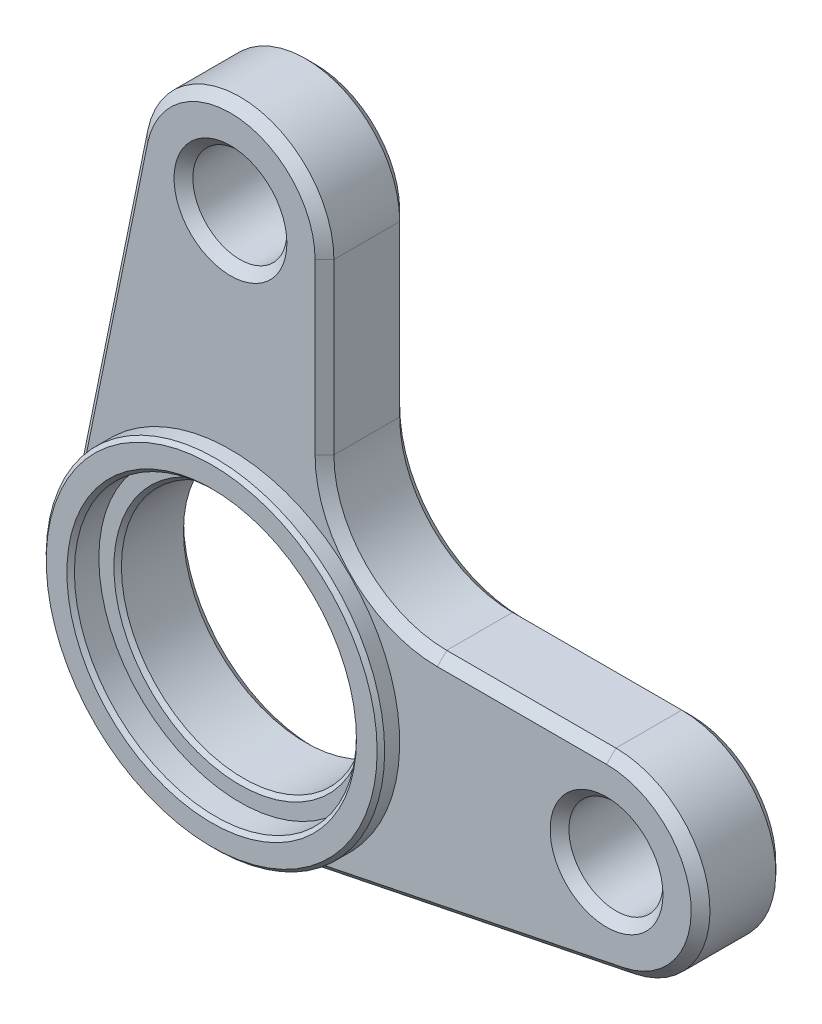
ISO-10303-21;
HEADER;
FILE_DESCRIPTION(('STEP AP214'),'2;1');
FILE_NAME('part.step','',(''),(''),'','','');
FILE_SCHEMA(('AUTOMOTIVE_DESIGN { 1 0 10303 214 1 1 1 1 }'));
ENDSEC;
DATA;
#1=APPLICATION_CONTEXT('core data for automotive mechanical design processes');
#2=APPLICATION_PROTOCOL_DEFINITION('international standard','automotive_design',2000,#1);
#3=PRODUCT_CONTEXT('',#1,'mechanical');
#4=PRODUCT('Part','Part','',(#3));
#5=PRODUCT_RELATED_PRODUCT_CATEGORY('part','',(#4));
#6=PRODUCT_DEFINITION_FORMATION('','',#4);
#7=PRODUCT_DEFINITION_CONTEXT('part definition',#1,'design');
#8=PRODUCT_DEFINITION('design','',#6,#7);
#9=PRODUCT_DEFINITION_SHAPE('','',#8);
#10=(LENGTH_UNIT() NAMED_UNIT(*) SI_UNIT(.MILLI.,.METRE.));
#11=(NAMED_UNIT(*) PLANE_ANGLE_UNIT() SI_UNIT($,.RADIAN.));
#12=(NAMED_UNIT(*) SI_UNIT($,.STERADIAN.) SOLID_ANGLE_UNIT());
#13=UNCERTAINTY_MEASURE_WITH_UNIT(LENGTH_MEASURE(1.E-05),#10,'distance_accuracy_value','');
#14=(GEOMETRIC_REPRESENTATION_CONTEXT(3) GLOBAL_UNCERTAINTY_ASSIGNED_CONTEXT((#13)) GLOBAL_UNIT_ASSIGNED_CONTEXT((#10,
#11,#12)) REPRESENTATION_CONTEXT('',''));
#15=CARTESIAN_POINT('',(0.,0.,0.));
#16=DIRECTION('',(0.,0.,1.));
#17=DIRECTION('',(1.,0.,0.));
#18=AXIS2_PLACEMENT_3D('',#15,#16,#17);
#19=CARTESIAN_POINT('',(0.,0.,4.5));
#20=DIRECTION('',(0.,0.,-1.));
#21=DIRECTION('',(-1.,0.,0.));
#22=AXIS2_PLACEMENT_3D('',#19,#20,#21);
#23=CYLINDRICAL_SURFACE('',#22,6.5);
#24=CARTESIAN_POINT('',(0.,0.,3.8));
#25=DIRECTION('',(0.,0.,1.));
#26=DIRECTION('',(1.,0.,0.));
#27=AXIS2_PLACEMENT_3D('',#24,#25,#26);
#28=CIRCLE('',#27,6.5);
#29=CARTESIAN_POINT('',(6.5,0.,3.8));
#30=VERTEX_POINT('',#29);
#31=EDGE_CURVE('E43',#30,#30,#28,.T.);
#32=ORIENTED_EDGE('',*,*,#31,.T.);
#33=EDGE_LOOP('',(#32));
#34=FACE_BOUND('',#33,.T.);
#35=CARTESIAN_POINT('',(0.,0.,0.500000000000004));
#36=DIRECTION('',(0.,0.,1.));
#37=DIRECTION('',(1.,0.,0.));
#38=AXIS2_PLACEMENT_3D('',#35,#36,#37);
#39=CIRCLE('',#38,6.5);
#40=CARTESIAN_POINT('',(6.5,0.,0.500000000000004));
#41=VERTEX_POINT('',#40);
#42=EDGE_CURVE('E221',#41,#41,#39,.F.);
#43=ORIENTED_EDGE('',*,*,#42,.T.);
#44=EDGE_LOOP('',(#43));
#45=FACE_BOUND('',#44,.T.);
#46=ADVANCED_FACE('F35',(#34,#45),#23,.F.);
#47=CARTESIAN_POINT('',(20.,0.,4.5));
#48=DIRECTION('',(0.,0.,1.));
#49=DIRECTION('',(1.,0.,0.));
#50=AXIS2_PLACEMENT_3D('',#47,#48,#49);
#51=PLANE('',#50);
#52=CARTESIAN_POINT('',(20.,0.,4.5));
#53=DIRECTION('',(0.,0.,1.));
#54=DIRECTION('',(1.,0.,0.));
#55=AXIS2_PLACEMENT_3D('',#52,#53,#54);
#56=CIRCLE('',#55,3.);
#57=CARTESIAN_POINT('',(23.,0.,4.5));
#58=VERTEX_POINT('',#57);
#59=EDGE_CURVE('E181',#58,#58,#56,.F.);
#60=ORIENTED_EDGE('',*,*,#59,.T.);
#61=EDGE_LOOP('',(#60));
#62=FACE_BOUND('',#61,.T.);
#63=CARTESIAN_POINT('',(0.,20.,4.5));
#64=DIRECTION('',(0.,0.,1.));
#65=DIRECTION('',(1.,0.,0.));
#66=AXIS2_PLACEMENT_3D('',#63,#64,#65);
#67=CIRCLE('',#66,3.);
#68=CARTESIAN_POINT('',(3.,20.,4.5));
#69=VERTEX_POINT('',#68);
#70=EDGE_CURVE('E177',#69,#69,#67,.F.);
#71=ORIENTED_EDGE('',*,*,#70,.T.);
#72=EDGE_LOOP('',(#71));
#73=FACE_BOUND('',#72,.T.);
#74=CARTESIAN_POINT('',(0.,0.,4.5));
#75=DIRECTION('',(0.,0.,1.));
#76=DIRECTION('',(1.,0.,0.));
#77=AXIS2_PLACEMENT_3D('',#74,#75,#76);
#78=CIRCLE('',#77,9.);
#79=CARTESIAN_POINT('',(4.59827534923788,-7.73665714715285,4.5));
#80=VERTEX_POINT('',#79);
#81=CARTESIAN_POINT('',(-7.73665714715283,4.5982753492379,4.5));
#82=VERTEX_POINT('',#81);
#83=EDGE_CURVE('E155',#80,#82,#78,.T.);
#84=ORIENTED_EDGE('',*,*,#83,.F.);
#85=DIRECTION('',(0.979795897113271,0.2,0.));
#86=VECTOR('',#85,1.);
#87=CARTESIAN_POINT('',(20.9,-4.40908153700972,4.5));
#88=LINE('',#87,#86);
#89=CARTESIAN_POINT('',(20.9,-4.40908153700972,4.5));
#90=VERTEX_POINT('',#89);
#91=EDGE_CURVE('E167',#80,#90,#88,.T.);
#92=ORIENTED_EDGE('',*,*,#91,.T.);
#93=CARTESIAN_POINT('',(20.,0.,4.5));
#94=DIRECTION('',(0.,0.,1.));
#95=DIRECTION('',(1.,0.,0.));
#96=AXIS2_PLACEMENT_3D('',#93,#94,#95);
#97=CIRCLE('',#96,4.5);
#98=CARTESIAN_POINT('',(20.,4.5,4.5));
#99=VERTEX_POINT('',#98);
#100=EDGE_CURVE('E178',#90,#99,#97,.T.);
#101=ORIENTED_EDGE('',*,*,#100,.T.);
#102=DIRECTION('',(-1.,0.,0.));
#103=VECTOR('',#102,1.);
#104=CARTESIAN_POINT('',(11.,4.5,4.5));
#105=LINE('',#104,#103);
#106=CARTESIAN_POINT('',(11.,4.5,4.5));
#107=VERTEX_POINT('',#106);
#108=EDGE_CURVE('E183',#99,#107,#105,.T.);
#109=ORIENTED_EDGE('',*,*,#108,.T.);
#110=CARTESIAN_POINT('',(11.,11.,4.5));
#111=DIRECTION('',(0.,0.,1.));
#112=DIRECTION('',(1.,0.,0.));
#113=AXIS2_PLACEMENT_3D('',#110,#111,#112);
#114=CIRCLE('',#113,6.5);
#115=CARTESIAN_POINT('',(4.5,11.,4.5));
#116=VERTEX_POINT('',#115);
#117=EDGE_CURVE('E494',#107,#116,#114,.F.);
#118=ORIENTED_EDGE('',*,*,#117,.T.);
#119=DIRECTION('',(0.,1.,0.));
#120=VECTOR('',#119,1.);
#121=CARTESIAN_POINT('',(4.5,20.,4.5));
#122=LINE('',#121,#120);
#123=CARTESIAN_POINT('',(4.5,20.,4.5));
#124=VERTEX_POINT('',#123);
#125=EDGE_CURVE('E490',#116,#124,#122,.T.);
#126=ORIENTED_EDGE('',*,*,#125,.T.);
#127=CARTESIAN_POINT('',(0.,20.,4.5));
#128=DIRECTION('',(0.,0.,1.));
#129=DIRECTION('',(1.,0.,0.));
#130=AXIS2_PLACEMENT_3D('',#127,#128,#129);
#131=CIRCLE('',#130,4.5);
#132=CARTESIAN_POINT('',(-4.40908153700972,20.9,4.5));
#133=VERTEX_POINT('',#132);
#134=EDGE_CURVE('E492',#124,#133,#131,.T.);
#135=ORIENTED_EDGE('',*,*,#134,.T.);
#136=DIRECTION('',(-0.2,-0.979795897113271,0.));
#137=VECTOR('',#136,1.);
#138=CARTESIAN_POINT('',(-8.3282651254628,1.7,4.5));
#139=LINE('',#138,#137);
#140=EDGE_CURVE('E169',#133,#82,#139,.T.);
#141=ORIENTED_EDGE('',*,*,#140,.T.);
#142=EDGE_LOOP('',(#84,#92,#101,#109,#118,#126,#135,#141));
#143=FACE_BOUND('',#142,.T.);
#144=ADVANCED_FACE('F166',(#62,#73,#143),#51,.T.);
#145=CARTESIAN_POINT('',(20.,0.,0.));
#146=DIRECTION('',(0.,0.,1.));
#147=DIRECTION('',(1.,0.,0.));
#148=AXIS2_PLACEMENT_3D('',#145,#146,#147);
#149=PLANE('',#148);
#150=CARTESIAN_POINT('',(20.,0.,0.));
#151=DIRECTION('',(0.,0.,1.));
#152=DIRECTION('',(1.,0.,0.));
#153=AXIS2_PLACEMENT_3D('',#150,#151,#152);
#154=CIRCLE('',#153,3.);
#155=CARTESIAN_POINT('',(23.,0.,0.));
#156=VERTEX_POINT('',#155);
#157=EDGE_CURVE('E218',#156,#156,#154,.T.);
#158=ORIENTED_EDGE('',*,*,#157,.T.);
#159=EDGE_LOOP('',(#158));
#160=FACE_BOUND('',#159,.T.);
#161=CARTESIAN_POINT('',(0.,20.,0.));
#162=DIRECTION('',(0.,0.,1.));
#163=DIRECTION('',(1.,0.,0.));
#164=AXIS2_PLACEMENT_3D('',#161,#162,#163);
#165=CIRCLE('',#164,3.);
#166=CARTESIAN_POINT('',(3.,20.,0.));
#167=VERTEX_POINT('',#166);
#168=EDGE_CURVE('E215',#167,#167,#165,.T.);
#169=ORIENTED_EDGE('',*,*,#168,.T.);
#170=EDGE_LOOP('',(#169));
#171=FACE_BOUND('',#170,.T.);
#172=CARTESIAN_POINT('',(0.,0.,0.));
#173=DIRECTION('',(0.,0.,1.));
#174=DIRECTION('',(1.,0.,0.));
#175=AXIS2_PLACEMENT_3D('',#172,#173,#174);
#176=CIRCLE('',#175,7.00000000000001);
#177=CARTESIAN_POINT('',(7.00000000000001,0.,0.));
#178=VERTEX_POINT('',#177);
#179=EDGE_CURVE('E212',#178,#178,#176,.T.);
#180=ORIENTED_EDGE('',*,*,#179,.T.);
#181=EDGE_LOOP('',(#180));
#182=FACE_BOUND('',#181,.T.);
#183=CARTESIAN_POINT('',(11.,11.,0.));
#184=DIRECTION('',(0.,0.,1.));
#185=DIRECTION('',(1.,0.,0.));
#186=AXIS2_PLACEMENT_3D('',#183,#184,#185);
#187=CIRCLE('',#186,6.50000000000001);
#188=CARTESIAN_POINT('',(4.49999999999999,11.,0.));
#189=VERTEX_POINT('',#188);
#190=CARTESIAN_POINT('',(11.,4.49999999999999,0.));
#191=VERTEX_POINT('',#190);
#192=EDGE_CURVE('E207',#189,#191,#187,.T.);
#193=ORIENTED_EDGE('',*,*,#192,.T.);
#194=DIRECTION('',(1.,0.,0.));
#195=VECTOR('',#194,1.);
#196=CARTESIAN_POINT('',(20.,4.49999999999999,0.));
#197=LINE('',#196,#195);
#198=CARTESIAN_POINT('',(20.,4.49999999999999,0.));
#199=VERTEX_POINT('',#198);
#200=EDGE_CURVE('E209',#191,#199,#197,.T.);
#201=ORIENTED_EDGE('',*,*,#200,.T.);
#202=CARTESIAN_POINT('',(20.,0.,0.));
#203=DIRECTION('',(0.,0.,1.));
#204=DIRECTION('',(1.,0.,0.));
#205=AXIS2_PLACEMENT_3D('',#202,#203,#204);
#206=CIRCLE('',#205,4.49999999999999);
#207=CARTESIAN_POINT('',(20.9,-4.40908153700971,0.));
#208=VERTEX_POINT('',#207);
#209=EDGE_CURVE('E195',#199,#208,#206,.F.);
#210=ORIENTED_EDGE('',*,*,#209,.T.);
#211=DIRECTION('',(-0.979795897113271,-0.2,0.));
#212=VECTOR('',#211,1.);
#213=CARTESIAN_POINT('',(20.9,-4.40908153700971,0.));
#214=LINE('',#213,#212);
#215=CARTESIAN_POINT('',(1.7,-8.3282651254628,0.));
#216=VERTEX_POINT('',#215);
#217=EDGE_CURVE('E197',#208,#216,#214,.T.);
#218=ORIENTED_EDGE('',*,*,#217,.T.);
#219=CARTESIAN_POINT('',(0.,0.,0.));
#220=DIRECTION('',(0.,0.,1.));
#221=DIRECTION('',(1.,0.,0.));
#222=AXIS2_PLACEMENT_3D('',#219,#220,#221);
#223=CIRCLE('',#222,8.49999999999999);
#224=CARTESIAN_POINT('',(-8.3282651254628,1.7,0.));
#225=VERTEX_POINT('',#224);
#226=EDGE_CURVE('E199',#216,#225,#223,.F.);
#227=ORIENTED_EDGE('',*,*,#226,.T.);
#228=DIRECTION('',(0.2,0.979795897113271,0.));
#229=VECTOR('',#228,1.);
#230=CARTESIAN_POINT('',(-7.52826512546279,5.61918358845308,0.));
#231=LINE('',#230,#229);
#232=CARTESIAN_POINT('',(-4.40908153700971,20.9,0.));
#233=VERTEX_POINT('',#232);
#234=EDGE_CURVE('E201',#225,#233,#231,.T.);
#235=ORIENTED_EDGE('',*,*,#234,.T.);
#236=CARTESIAN_POINT('',(0.,20.,0.));
#237=DIRECTION('',(0.,0.,1.));
#238=DIRECTION('',(1.,0.,0.));
#239=AXIS2_PLACEMENT_3D('',#236,#237,#238);
#240=CIRCLE('',#239,4.49999999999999);
#241=CARTESIAN_POINT('',(4.49999999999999,20.,0.));
#242=VERTEX_POINT('',#241);
#243=EDGE_CURVE('E203',#233,#242,#240,.F.);
#244=ORIENTED_EDGE('',*,*,#243,.T.);
#245=DIRECTION('',(0.,-1.,0.));
#246=VECTOR('',#245,1.);
#247=CARTESIAN_POINT('',(4.49999999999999,0.,0.));
#248=LINE('',#247,#246);
#249=EDGE_CURVE('E205',#242,#189,#248,.T.);
#250=ORIENTED_EDGE('',*,*,#249,.T.);
#251=EDGE_LOOP('',(#193,#201,#210,#218,#227,#235,#244,#250));
#252=FACE_BOUND('',#251,.T.);
#253=ADVANCED_FACE('F322',(#160,#171,#182,#252),#149,.F.);
#254=CARTESIAN_POINT('',(20.,0.,4.5));
#255=DIRECTION('',(0.,0.,-1.));
#256=DIRECTION('',(-1.,0.,0.));
#257=AXIS2_PLACEMENT_3D('',#254,#255,#256);
#258=CYLINDRICAL_SURFACE('',#257,5.);
#259=DIRECTION('',(0.,0.,-1.));
#260=VECTOR('',#259,1.);
#261=CARTESIAN_POINT('',(21.,-4.89897948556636,4.5));
#262=LINE('',#261,#260);
#263=CARTESIAN_POINT('',(21.,-4.89897948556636,4.));
#264=VERTEX_POINT('',#263);
#265=CARTESIAN_POINT('',(21.,-4.89897948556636,0.500000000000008));
#266=VERTEX_POINT('',#265);
#267=EDGE_CURVE('E464',#264,#266,#262,.T.);
#268=ORIENTED_EDGE('',*,*,#267,.T.);
#269=CARTESIAN_POINT('',(20.,0.,0.500000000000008));
#270=DIRECTION('',(0.,0.,1.));
#271=DIRECTION('',(1.,0.,0.));
#272=AXIS2_PLACEMENT_3D('',#269,#270,#271);
#273=CIRCLE('',#272,5.);
#274=CARTESIAN_POINT('',(20.,5.,0.500000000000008));
#275=VERTEX_POINT('',#274);
#276=EDGE_CURVE('E162',#266,#275,#273,.T.);
#277=ORIENTED_EDGE('',*,*,#276,.T.);
#278=DIRECTION('',(0.,0.,-1.));
#279=VECTOR('',#278,1.);
#280=CARTESIAN_POINT('',(20.,5.,4.5));
#281=LINE('',#280,#279);
#282=CARTESIAN_POINT('',(20.,5.,4.));
#283=VERTEX_POINT('',#282);
#284=EDGE_CURVE('E171',#283,#275,#281,.T.);
#285=ORIENTED_EDGE('',*,*,#284,.F.);
#286=CARTESIAN_POINT('',(20.,0.,4.));
#287=DIRECTION('',(0.,0.,1.));
#288=DIRECTION('',(1.,0.,0.));
#289=AXIS2_PLACEMENT_3D('',#286,#287,#288);
#290=CIRCLE('',#289,5.);
#291=EDGE_CURVE('E57',#283,#264,#290,.F.);
#292=ORIENTED_EDGE('',*,*,#291,.T.);
#293=EDGE_LOOP('',(#268,#277,#285,#292));
#294=FACE_BOUND('',#293,.T.);
#295=ADVANCED_FACE('F331',(#294),#258,.T.);
#296=CARTESIAN_POINT('',(11.,5.,4.5));
#297=DIRECTION('',(0.,-1.,0.));
#298=DIRECTION('',(0.,0.,-1.));
#299=AXIS2_PLACEMENT_3D('',#296,#297,#298);
#300=PLANE('',#299);
#301=ORIENTED_EDGE('',*,*,#284,.T.);
#302=DIRECTION('',(-1.,0.,0.));
#303=VECTOR('',#302,1.);
#304=CARTESIAN_POINT('',(11.,5.,0.500000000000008));
#305=LINE('',#304,#303);
#306=CARTESIAN_POINT('',(11.,5.,0.500000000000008));
#307=VERTEX_POINT('',#306);
#308=EDGE_CURVE('E226',#275,#307,#305,.T.);
#309=ORIENTED_EDGE('',*,*,#308,.T.);
#310=DIRECTION('',(0.,0.,-1.));
#311=VECTOR('',#310,1.);
#312=CARTESIAN_POINT('',(11.,5.,4.5));
#313=LINE('',#312,#311);
#314=CARTESIAN_POINT('',(11.,5.,4.));
#315=VERTEX_POINT('',#314);
#316=EDGE_CURVE('E480',#315,#307,#313,.T.);
#317=ORIENTED_EDGE('',*,*,#316,.F.);
#318=DIRECTION('',(1.,0.,0.));
#319=VECTOR('',#318,1.);
#320=CARTESIAN_POINT('',(20.,5.,4.));
#321=LINE('',#320,#319);
#322=EDGE_CURVE('E224',#315,#283,#321,.T.);
#323=ORIENTED_EDGE('',*,*,#322,.T.);
#324=EDGE_LOOP('',(#301,#309,#317,#323));
#325=FACE_BOUND('',#324,.T.);
#326=ADVANCED_FACE('F354',(#325),#300,.F.);
#327=CARTESIAN_POINT('',(11.,11.,4.5));
#328=DIRECTION('',(0.,0.,-1.));
#329=DIRECTION('',(-1.,0.,0.));
#330=AXIS2_PLACEMENT_3D('',#327,#328,#329);
#331=CYLINDRICAL_SURFACE('',#330,6.);
#332=ORIENTED_EDGE('',*,*,#316,.T.);
#333=CARTESIAN_POINT('',(11.,11.,0.500000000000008));
#334=DIRECTION('',(0.,0.,1.));
#335=DIRECTION('',(1.,0.,0.));
#336=AXIS2_PLACEMENT_3D('',#333,#334,#335);
#337=CIRCLE('',#336,6.);
#338=CARTESIAN_POINT('',(5.,11.,0.500000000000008));
#339=VERTEX_POINT('',#338);
#340=EDGE_CURVE('E231',#307,#339,#337,.F.);
#341=ORIENTED_EDGE('',*,*,#340,.T.);
#342=DIRECTION('',(0.,0.,-1.));
#343=VECTOR('',#342,1.);
#344=CARTESIAN_POINT('',(5.,11.,4.5));
#345=LINE('',#344,#343);
#346=CARTESIAN_POINT('',(5.,11.,4.));
#347=VERTEX_POINT('',#346);
#348=EDGE_CURVE('E477',#347,#339,#345,.T.);
#349=ORIENTED_EDGE('',*,*,#348,.F.);
#350=CARTESIAN_POINT('',(11.,11.,4.));
#351=DIRECTION('',(0.,0.,1.));
#352=DIRECTION('',(1.,0.,0.));
#353=AXIS2_PLACEMENT_3D('',#350,#351,#352);
#354=CIRCLE('',#353,6.);
#355=EDGE_CURVE('E229',#347,#315,#354,.T.);
#356=ORIENTED_EDGE('',*,*,#355,.T.);
#357=EDGE_LOOP('',(#332,#341,#349,#356));
#358=FACE_BOUND('',#357,.T.);
#359=ADVANCED_FACE('F350',(#358),#331,.F.);
#360=CARTESIAN_POINT('',(5.,20.,4.5));
#361=DIRECTION('',(-1.,0.,0.));
#362=DIRECTION('',(0.,-1.,0.));
#363=AXIS2_PLACEMENT_3D('',#360,#361,#362);
#364=PLANE('',#363);
#365=ORIENTED_EDGE('',*,*,#348,.T.);
#366=DIRECTION('',(0.,1.,0.));
#367=VECTOR('',#366,1.);
#368=CARTESIAN_POINT('',(5.,20.,0.500000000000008));
#369=LINE('',#368,#367);
#370=CARTESIAN_POINT('',(5.,20.,0.500000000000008));
#371=VERTEX_POINT('',#370);
#372=EDGE_CURVE('E235',#339,#371,#369,.T.);
#373=ORIENTED_EDGE('',*,*,#372,.T.);
#374=DIRECTION('',(0.,0.,-1.));
#375=VECTOR('',#374,1.);
#376=CARTESIAN_POINT('',(5.,20.,4.5));
#377=LINE('',#376,#375);
#378=CARTESIAN_POINT('',(5.,20.,4.));
#379=VERTEX_POINT('',#378);
#380=EDGE_CURVE('E474',#379,#371,#377,.T.);
#381=ORIENTED_EDGE('',*,*,#380,.F.);
#382=DIRECTION('',(0.,-1.,0.));
#383=VECTOR('',#382,1.);
#384=CARTESIAN_POINT('',(5.,11.,4.));
#385=LINE('',#384,#383);
#386=EDGE_CURVE('E233',#379,#347,#385,.T.);
#387=ORIENTED_EDGE('',*,*,#386,.T.);
#388=EDGE_LOOP('',(#365,#373,#381,#387));
#389=FACE_BOUND('',#388,.T.);
#390=ADVANCED_FACE('F346',(#389),#364,.F.);
#391=CARTESIAN_POINT('',(0.,20.,4.5));
#392=DIRECTION('',(0.,0.,-1.));
#393=DIRECTION('',(-1.,0.,0.));
#394=AXIS2_PLACEMENT_3D('',#391,#392,#393);
#395=CYLINDRICAL_SURFACE('',#394,5.);
#396=ORIENTED_EDGE('',*,*,#380,.T.);
#397=CARTESIAN_POINT('',(0.,20.,0.500000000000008));
#398=DIRECTION('',(0.,0.,1.));
#399=DIRECTION('',(1.,0.,0.));
#400=AXIS2_PLACEMENT_3D('',#397,#398,#399);
#401=CIRCLE('',#400,5.);
#402=CARTESIAN_POINT('',(-4.89897948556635,21.,0.500000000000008));
#403=VERTEX_POINT('',#402);
#404=EDGE_CURVE('E239',#371,#403,#401,.T.);
#405=ORIENTED_EDGE('',*,*,#404,.T.);
#406=DIRECTION('',(0.,0.,-1.));
#407=VECTOR('',#406,1.);
#408=CARTESIAN_POINT('',(-4.89897948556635,21.,4.5));
#409=LINE('',#408,#407);
#410=CARTESIAN_POINT('',(-4.89897948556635,21.,4.));
#411=VERTEX_POINT('',#410);
#412=EDGE_CURVE('E471',#411,#403,#409,.T.);
#413=ORIENTED_EDGE('',*,*,#412,.F.);
#414=CARTESIAN_POINT('',(0.,20.,4.));
#415=DIRECTION('',(0.,0.,1.));
#416=DIRECTION('',(1.,0.,0.));
#417=AXIS2_PLACEMENT_3D('',#414,#415,#416);
#418=CIRCLE('',#417,5.);
#419=EDGE_CURVE('E237',#411,#379,#418,.F.);
#420=ORIENTED_EDGE('',*,*,#419,.T.);
#421=EDGE_LOOP('',(#396,#405,#413,#420));
#422=FACE_BOUND('',#421,.T.);
#423=ADVANCED_FACE('F342',(#422),#395,.T.);
#424=CARTESIAN_POINT('',(-4.89897948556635,21.,4.5));
#425=DIRECTION('',(0.979795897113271,-0.2,0.));
#426=DIRECTION('',(0.2,0.979795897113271,0.));
#427=AXIS2_PLACEMENT_3D('',#424,#425,#426);
#428=PLANE('',#427);
#429=ORIENTED_EDGE('',*,*,#412,.T.);
#430=DIRECTION('',(-0.2,-0.979795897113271,0.));
#431=VECTOR('',#430,1.);
#432=CARTESIAN_POINT('',(-4.89897948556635,21.,0.500000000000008));
#433=LINE('',#432,#431);
#434=CARTESIAN_POINT('',(-8.81816307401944,1.8,0.500000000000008));
#435=VERTEX_POINT('',#434);
#436=EDGE_CURVE('E243',#403,#435,#433,.T.);
#437=ORIENTED_EDGE('',*,*,#436,.T.);
#438=DIRECTION('',(0.,0.,-1.));
#439=VECTOR('',#438,1.);
#440=CARTESIAN_POINT('',(-8.81816307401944,1.8,4.5));
#441=LINE('',#440,#439);
#442=CARTESIAN_POINT('',(-8.81816307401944,1.8,4.));
#443=VERTEX_POINT('',#442);
#444=EDGE_CURVE('E469',#443,#435,#441,.T.);
#445=ORIENTED_EDGE('',*,*,#444,.F.);
#446=DIRECTION('',(0.2,0.979795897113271,0.));
#447=VECTOR('',#446,1.);
#448=CARTESIAN_POINT('',(-4.89897948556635,21.,4.));
#449=LINE('',#448,#447);
#450=EDGE_CURVE('E241',#443,#411,#449,.T.);
#451=ORIENTED_EDGE('',*,*,#450,.T.);
#452=EDGE_LOOP('',(#429,#437,#445,#451));
#453=FACE_BOUND('',#452,.T.);
#454=ADVANCED_FACE('F338',(#453),#428,.F.);
#455=CARTESIAN_POINT('',(0.,0.,4.5));
#456=DIRECTION('',(0.,0.,-1.));
#457=DIRECTION('',(-1.,0.,0.));
#458=AXIS2_PLACEMENT_3D('',#455,#456,#457);
#459=CYLINDRICAL_SURFACE('',#458,9.);
#460=CARTESIAN_POINT('',(0.,0.,5.3));
#461=DIRECTION('',(0.,0.,1.));
#462=DIRECTION('',(1.,0.,0.));
#463=AXIS2_PLACEMENT_3D('',#460,#461,#462);
#464=CIRCLE('',#463,9.);
#465=CARTESIAN_POINT('',(9.,0.,5.3));
#466=VERTEX_POINT('',#465);
#467=EDGE_CURVE('E298',#466,#466,#464,.F.);
#468=ORIENTED_EDGE('',*,*,#467,.T.);
#469=EDGE_LOOP('',(#468));
#470=FACE_BOUND('',#469,.T.);
#471=ORIENTED_EDGE('',*,*,#444,.T.);
#472=CARTESIAN_POINT('',(0.,0.,0.500000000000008));
#473=DIRECTION('',(0.,0.,1.));
#474=DIRECTION('',(1.,0.,0.));
#475=AXIS2_PLACEMENT_3D('',#472,#473,#474);
#476=CIRCLE('',#475,9.);
#477=CARTESIAN_POINT('',(1.8,-8.81816307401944,0.500000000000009));
#478=VERTEX_POINT('',#477);
#479=EDGE_CURVE('E245',#435,#478,#476,.T.);
#480=ORIENTED_EDGE('',*,*,#479,.T.);
#481=DIRECTION('',(0.,0.,-1.));
#482=VECTOR('',#481,1.);
#483=CARTESIAN_POINT('',(1.8,-8.81816307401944,4.5));
#484=LINE('',#483,#482);
#485=CARTESIAN_POINT('',(1.8,-8.81816307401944,4.));
#486=VERTEX_POINT('',#485);
#487=EDGE_CURVE('E157',#486,#478,#484,.T.);
#488=ORIENTED_EDGE('',*,*,#487,.F.);
#489=CARTESIAN_POINT('',(0.,0.,13.));
#490=DIRECTION('',(0.14142135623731,-0.692820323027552,0.707106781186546));
#491=DIRECTION('',(0.141421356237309,-0.69282032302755,-0.707106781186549));
#492=AXIS2_PLACEMENT_3D('',#489,#490,#491);
#493=ELLIPSE('',#492,12.7279220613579,9.);
#494=EDGE_CURVE('E151',#486,#80,#493,.T.);
#495=ORIENTED_EDGE('',*,*,#494,.T.);
#496=ORIENTED_EDGE('',*,*,#83,.T.);
#497=CARTESIAN_POINT('',(0.,0.,12.9999999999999));
#498=DIRECTION('',(-0.692820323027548,0.141421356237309,0.70710678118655));
#499=DIRECTION('',(-0.692820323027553,0.14142135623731,-0.707106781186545));
#500=AXIS2_PLACEMENT_3D('',#497,#498,#499);
#501=ELLIPSE('',#500,12.7279220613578,9.);
#502=EDGE_CURVE('E161',#82,#443,#501,.T.);
#503=ORIENTED_EDGE('',*,*,#502,.T.);
#504=EDGE_LOOP('',(#471,#480,#488,#495,#496,#503));
#505=FACE_BOUND('',#504,.T.);
#506=ADVANCED_FACE('F154',(#470,#505),#459,.T.);
#507=CARTESIAN_POINT('',(1.8,-8.81816307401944,4.5));
#508=DIRECTION('',(-0.2,0.979795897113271,0.));
#509=DIRECTION('',(-0.979795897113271,-0.2,0.));
#510=AXIS2_PLACEMENT_3D('',#507,#508,#509);
#511=PLANE('',#510);
#512=ORIENTED_EDGE('',*,*,#487,.T.);
#513=DIRECTION('',(0.979795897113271,0.2,0.));
#514=VECTOR('',#513,1.);
#515=CARTESIAN_POINT('',(1.8,-8.81816307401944,0.500000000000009));
#516=LINE('',#515,#514);
#517=EDGE_CURVE('E50',#478,#266,#516,.T.);
#518=ORIENTED_EDGE('',*,*,#517,.T.);
#519=ORIENTED_EDGE('',*,*,#267,.F.);
#520=DIRECTION('',(-0.979795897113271,-0.2,0.));
#521=VECTOR('',#520,1.);
#522=CARTESIAN_POINT('',(1.8,-8.81816307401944,4.));
#523=LINE('',#522,#521);
#524=EDGE_CURVE('E247',#264,#486,#523,.T.);
#525=ORIENTED_EDGE('',*,*,#524,.T.);
#526=EDGE_LOOP('',(#512,#518,#519,#525));
#527=FACE_BOUND('',#526,.T.);
#528=ADVANCED_FACE('F333',(#527),#511,.F.);
#529=CARTESIAN_POINT('',(0.,20.,4.5));
#530=DIRECTION('',(0.,0.,-1.));
#531=DIRECTION('',(-1.,0.,0.));
#532=AXIS2_PLACEMENT_3D('',#529,#530,#531);
#533=CYLINDRICAL_SURFACE('',#532,2.5);
#534=CARTESIAN_POINT('',(0.,20.,4.));
#535=DIRECTION('',(0.,0.,1.));
#536=DIRECTION('',(1.,0.,0.));
#537=AXIS2_PLACEMENT_3D('',#534,#535,#536);
#538=CIRCLE('',#537,2.5);
#539=CARTESIAN_POINT('',(2.5,20.,4.));
#540=VERTEX_POINT('',#539);
#541=EDGE_CURVE('E192',#540,#540,#538,.T.);
#542=ORIENTED_EDGE('',*,*,#541,.T.);
#543=EDGE_LOOP('',(#542));
#544=FACE_BOUND('',#543,.T.);
#545=CARTESIAN_POINT('',(0.,20.,0.500000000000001));
#546=DIRECTION('',(0.,0.,1.));
#547=DIRECTION('',(1.,0.,0.));
#548=AXIS2_PLACEMENT_3D('',#545,#546,#547);
#549=CIRCLE('',#548,2.5);
#550=CARTESIAN_POINT('',(2.5,20.,0.500000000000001));
#551=VERTEX_POINT('',#550);
#552=EDGE_CURVE('E189',#551,#551,#549,.F.);
#553=ORIENTED_EDGE('',*,*,#552,.T.);
#554=EDGE_LOOP('',(#553));
#555=FACE_BOUND('',#554,.T.);
#556=ADVANCED_FACE('F326',(#544,#555),#533,.F.);
#557=CARTESIAN_POINT('',(20.,0.,4.5));
#558=DIRECTION('',(0.,0.,-1.));
#559=DIRECTION('',(-1.,0.,0.));
#560=AXIS2_PLACEMENT_3D('',#557,#558,#559);
#561=CYLINDRICAL_SURFACE('',#560,2.5);
#562=CARTESIAN_POINT('',(20.,0.,3.99999999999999));
#563=DIRECTION('',(0.,0.,1.));
#564=DIRECTION('',(1.,0.,0.));
#565=AXIS2_PLACEMENT_3D('',#562,#563,#564);
#566=CIRCLE('',#565,2.5);
#567=CARTESIAN_POINT('',(22.5,0.,3.99999999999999));
#568=VERTEX_POINT('',#567);
#569=EDGE_CURVE('E487',#568,#568,#566,.T.);
#570=ORIENTED_EDGE('',*,*,#569,.T.);
#571=EDGE_LOOP('',(#570));
#572=FACE_BOUND('',#571,.T.);
#573=CARTESIAN_POINT('',(20.,0.,0.500000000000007));
#574=DIRECTION('',(0.,0.,1.));
#575=DIRECTION('',(1.,0.,0.));
#576=AXIS2_PLACEMENT_3D('',#573,#574,#575);
#577=CIRCLE('',#576,2.5);
#578=CARTESIAN_POINT('',(22.5,0.,0.500000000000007));
#579=VERTEX_POINT('',#578);
#580=EDGE_CURVE('E170',#579,#579,#577,.F.);
#581=ORIENTED_EDGE('',*,*,#580,.T.);
#582=EDGE_LOOP('',(#581));
#583=FACE_BOUND('',#582,.T.);
#584=ADVANCED_FACE('F452',(#572,#583),#561,.F.);
#585=CARTESIAN_POINT('',(0.,0.,5.5));
#586=DIRECTION('',(0.,0.,1.));
#587=DIRECTION('',(1.,0.,0.));
#588=AXIS2_PLACEMENT_3D('',#585,#586,#587);
#589=PLANE('',#588);
#590=CARTESIAN_POINT('',(0.,0.,5.5));
#591=DIRECTION('',(0.,0.,1.));
#592=DIRECTION('',(1.,0.,0.));
#593=AXIS2_PLACEMENT_3D('',#590,#591,#592);
#594=CIRCLE('',#593,8.8);
#595=CARTESIAN_POINT('',(8.8,0.,5.5));
#596=VERTEX_POINT('',#595);
#597=EDGE_CURVE('E295',#596,#596,#594,.T.);
#598=ORIENTED_EDGE('',*,*,#597,.T.);
#599=EDGE_LOOP('',(#598));
#600=FACE_BOUND('',#599,.T.);
#601=CARTESIAN_POINT('',(0.,0.,5.5));
#602=DIRECTION('',(0.,0.,1.));
#603=DIRECTION('',(1.,0.,0.));
#604=AXIS2_PLACEMENT_3D('',#601,#602,#603);
#605=CIRCLE('',#604,7.70000000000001);
#606=CARTESIAN_POINT('',(7.70000000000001,0.,5.5));
#607=VERTEX_POINT('',#606);
#608=EDGE_CURVE('E253',#607,#607,#605,.F.);
#609=ORIENTED_EDGE('',*,*,#608,.T.);
#610=EDGE_LOOP('',(#609));
#611=FACE_BOUND('',#610,.T.);
#612=ADVANCED_FACE('F448',(#600,#611),#589,.T.);
#613=CARTESIAN_POINT('',(0.,0.,4.));
#614=DIRECTION('',(0.,0.,1.));
#615=DIRECTION('',(1.,0.,0.));
#616=AXIS2_PLACEMENT_3D('',#613,#614,#615);
#617=CYLINDRICAL_SURFACE('',#616,7.5);
#618=CARTESIAN_POINT('',(0.,0.,5.3));
#619=DIRECTION('',(0.,0.,1.));
#620=DIRECTION('',(1.,0.,0.));
#621=AXIS2_PLACEMENT_3D('',#618,#619,#620);
#622=CIRCLE('',#621,7.5);
#623=CARTESIAN_POINT('',(7.5,0.,5.3));
#624=VERTEX_POINT('',#623);
#625=EDGE_CURVE('E301',#624,#624,#622,.T.);
#626=ORIENTED_EDGE('',*,*,#625,.T.);
#627=EDGE_LOOP('',(#626));
#628=FACE_BOUND('',#627,.T.);
#629=CARTESIAN_POINT('',(0.,0.,4.));
#630=DIRECTION('',(0.,0.,1.));
#631=DIRECTION('',(1.,0.,0.));
#632=AXIS2_PLACEMENT_3D('',#629,#630,#631);
#633=CIRCLE('',#632,7.5);
#634=CARTESIAN_POINT('',(7.5,0.,4.));
#635=VERTEX_POINT('',#634);
#636=EDGE_CURVE('E277',#635,#635,#633,.T.);
#637=ORIENTED_EDGE('',*,*,#636,.F.);
#638=EDGE_LOOP('',(#637));
#639=FACE_BOUND('',#638,.T.);
#640=ADVANCED_FACE('F451',(#628,#639),#617,.F.);
#641=CARTESIAN_POINT('',(0.,0.,4.));
#642=DIRECTION('',(0.,0.,1.));
#643=DIRECTION('',(1.,0.,0.));
#644=AXIS2_PLACEMENT_3D('',#641,#642,#643);
#645=PLANE('',#644);
#646=CARTESIAN_POINT('',(0.,0.,4.));
#647=DIRECTION('',(0.,0.,1.));
#648=DIRECTION('',(1.,0.,0.));
#649=AXIS2_PLACEMENT_3D('',#646,#647,#648);
#650=CIRCLE('',#649,6.69999999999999);
#651=CARTESIAN_POINT('',(6.69999999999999,0.,4.));
#652=VERTEX_POINT('',#651);
#653=EDGE_CURVE('E11',#652,#652,#650,.F.);
#654=ORIENTED_EDGE('',*,*,#653,.T.);
#655=EDGE_LOOP('',(#654));
#656=FACE_BOUND('',#655,.T.);
#657=ORIENTED_EDGE('',*,*,#636,.T.);
#658=EDGE_LOOP('',(#657));
#659=FACE_BOUND('',#658,.T.);
#660=ADVANCED_FACE('F365',(#656,#659),#645,.T.);
#661=CARTESIAN_POINT('',(20.,0.,3.99999999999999));
#662=DIRECTION('',(0.,0.,1.));
#663=DIRECTION('',(1.,0.,0.));
#664=AXIS2_PLACEMENT_3D('',#661,#662,#663);
#665=CONICAL_SURFACE('',#664,2.5,0.785398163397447);
#666=ORIENTED_EDGE('',*,*,#59,.F.);
#667=EDGE_LOOP('',(#666));
#668=FACE_BOUND('',#667,.T.);
#669=ORIENTED_EDGE('',*,*,#569,.F.);
#670=EDGE_LOOP('',(#669));
#671=FACE_BOUND('',#670,.T.);
#672=ADVANCED_FACE('F361',(#668,#671),#665,.F.);
#673=CARTESIAN_POINT('',(0.,20.,4.));
#674=DIRECTION('',(0.,0.,1.));
#675=DIRECTION('',(1.,0.,0.));
#676=AXIS2_PLACEMENT_3D('',#673,#674,#675);
#677=CONICAL_SURFACE('',#676,2.5,0.785398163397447);
#678=ORIENTED_EDGE('',*,*,#70,.F.);
#679=EDGE_LOOP('',(#678));
#680=FACE_BOUND('',#679,.T.);
#681=ORIENTED_EDGE('',*,*,#541,.F.);
#682=EDGE_LOOP('',(#681));
#683=FACE_BOUND('',#682,.T.);
#684=ADVANCED_FACE('F364',(#680,#683),#677,.F.);
#685=CARTESIAN_POINT('',(20.,0.,0.));
#686=DIRECTION('',(0.,0.,-1.));
#687=DIRECTION('',(-1.,0.,0.));
#688=AXIS2_PLACEMENT_3D('',#685,#686,#687);
#689=CONICAL_SURFACE('',#688,3.,0.785398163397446);
#690=ORIENTED_EDGE('',*,*,#580,.F.);
#691=EDGE_LOOP('',(#690));
#692=FACE_BOUND('',#691,.T.);
#693=ORIENTED_EDGE('',*,*,#157,.F.);
#694=EDGE_LOOP('',(#693));
#695=FACE_BOUND('',#694,.T.);
#696=ADVANCED_FACE('F369',(#692,#695),#689,.F.);
#697=CARTESIAN_POINT('',(0.,20.,0.));
#698=DIRECTION('',(0.,0.,-1.));
#699=DIRECTION('',(-1.,0.,0.));
#700=AXIS2_PLACEMENT_3D('',#697,#698,#699);
#701=CONICAL_SURFACE('',#700,3.,0.78539816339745);
#702=ORIENTED_EDGE('',*,*,#552,.F.);
#703=EDGE_LOOP('',(#702));
#704=FACE_BOUND('',#703,.T.);
#705=ORIENTED_EDGE('',*,*,#168,.F.);
#706=EDGE_LOOP('',(#705));
#707=FACE_BOUND('',#706,.T.);
#708=ADVANCED_FACE('F373',(#704,#707),#701,.F.);
#709=CARTESIAN_POINT('',(0.,0.,0.));
#710=DIRECTION('',(0.,0.,-1.));
#711=DIRECTION('',(-1.,0.,0.));
#712=AXIS2_PLACEMENT_3D('',#709,#710,#711);
#713=CONICAL_SURFACE('',#712,7.00000000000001,0.78539816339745);
#714=ORIENTED_EDGE('',*,*,#42,.F.);
#715=EDGE_LOOP('',(#714));
#716=FACE_BOUND('',#715,.T.);
#717=ORIENTED_EDGE('',*,*,#179,.F.);
#718=EDGE_LOOP('',(#717));
#719=FACE_BOUND('',#718,.T.);
#720=ADVANCED_FACE('F377',(#716,#719),#713,.F.);
#721=CARTESIAN_POINT('',(-4.89897948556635,21.,0.500000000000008));
#722=DIRECTION('',(0.692820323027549,-0.141421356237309,0.70710678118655));
#723=DIRECTION('',(-0.2,-0.979795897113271,0.));
#724=AXIS2_PLACEMENT_3D('',#721,#722,#723);
#725=PLANE('',#724);
#726=DIRECTION('',(-0.692820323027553,0.141421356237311,0.707106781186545));
#727=VECTOR('',#726,1.);
#728=CARTESIAN_POINT('',(-4.40908153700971,20.9,0.));
#729=LINE('',#728,#727);
#730=EDGE_CURVE('E271',#233,#403,#729,.T.);
#731=ORIENTED_EDGE('',*,*,#730,.F.);
#732=ORIENTED_EDGE('',*,*,#234,.F.);
#733=DIRECTION('',(0.692820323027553,-0.14142135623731,-0.707106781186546));
#734=VECTOR('',#733,1.);
#735=CARTESIAN_POINT('',(-8.81816307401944,1.8,0.500000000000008));
#736=LINE('',#735,#734);
#737=EDGE_CURVE('E274',#435,#225,#736,.T.);
#738=ORIENTED_EDGE('',*,*,#737,.F.);
#739=ORIENTED_EDGE('',*,*,#436,.F.);
#740=EDGE_LOOP('',(#731,#732,#738,#739));
#741=FACE_BOUND('',#740,.T.);
#742=ADVANCED_FACE('F381',(#741),#725,.F.);
#743=CARTESIAN_POINT('',(0.,0.,0.500000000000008));
#744=DIRECTION('',(0.,0.,1.));
#745=DIRECTION('',(1.,0.,0.));
#746=AXIS2_PLACEMENT_3D('',#743,#744,#745);
#747=CONICAL_SURFACE('',#746,9.,0.785398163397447);
#748=ORIENTED_EDGE('',*,*,#737,.T.);
#749=ORIENTED_EDGE('',*,*,#226,.F.);
#750=DIRECTION('',(-0.141421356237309,0.69282032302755,-0.707106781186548));
#751=VECTOR('',#750,1.);
#752=CARTESIAN_POINT('',(1.8,-8.81816307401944,0.500000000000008));
#753=LINE('',#752,#751);
#754=EDGE_CURVE('E268',#478,#216,#753,.T.);
#755=ORIENTED_EDGE('',*,*,#754,.F.);
#756=ORIENTED_EDGE('',*,*,#479,.F.);
#757=EDGE_LOOP('',(#748,#749,#755,#756));
#758=FACE_BOUND('',#757,.T.);
#759=ADVANCED_FACE('F407',(#758),#747,.T.);
#760=CARTESIAN_POINT('',(0.,20.,0.500000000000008));
#761=DIRECTION('',(0.,0.,1.));
#762=DIRECTION('',(1.,0.,0.));
#763=AXIS2_PLACEMENT_3D('',#760,#761,#762);
#764=CONICAL_SURFACE('',#763,5.,0.785398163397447);
#765=ORIENTED_EDGE('',*,*,#730,.T.);
#766=ORIENTED_EDGE('',*,*,#404,.F.);
#767=DIRECTION('',(0.707106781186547,0.,0.707106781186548));
#768=VECTOR('',#767,1.);
#769=CARTESIAN_POINT('',(4.49999999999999,20.,0.));
#770=LINE('',#769,#768);
#771=EDGE_CURVE('E265',#242,#371,#770,.T.);
#772=ORIENTED_EDGE('',*,*,#771,.F.);
#773=ORIENTED_EDGE('',*,*,#243,.F.);
#774=EDGE_LOOP('',(#765,#766,#772,#773));
#775=FACE_BOUND('',#774,.T.);
#776=ADVANCED_FACE('F403',(#775),#764,.T.);
#777=CARTESIAN_POINT('',(1.8,-8.81816307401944,0.500000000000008));
#778=DIRECTION('',(-0.141421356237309,0.692820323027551,0.707106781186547));
#779=DIRECTION('',(0.979795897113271,0.2,0.));
#780=AXIS2_PLACEMENT_3D('',#777,#778,#779);
#781=PLANE('',#780);
#782=ORIENTED_EDGE('',*,*,#754,.T.);
#783=ORIENTED_EDGE('',*,*,#217,.F.);
#784=DIRECTION('',(-0.141421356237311,0.69282032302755,-0.707106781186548));
#785=VECTOR('',#784,1.);
#786=CARTESIAN_POINT('',(21.,-4.89897948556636,0.500000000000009));
#787=LINE('',#786,#785);
#788=EDGE_CURVE('E262',#266,#208,#787,.T.);
#789=ORIENTED_EDGE('',*,*,#788,.F.);
#790=ORIENTED_EDGE('',*,*,#517,.F.);
#791=EDGE_LOOP('',(#782,#783,#789,#790));
#792=FACE_BOUND('',#791,.T.);
#793=ADVANCED_FACE('F399',(#792),#781,.F.);
#794=CARTESIAN_POINT('',(5.,20.,0.500000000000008));
#795=DIRECTION('',(-0.707106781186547,0.,0.707106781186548));
#796=DIRECTION('',(0.,1.,0.));
#797=AXIS2_PLACEMENT_3D('',#794,#795,#796);
#798=PLANE('',#797);
#799=ORIENTED_EDGE('',*,*,#771,.T.);
#800=ORIENTED_EDGE('',*,*,#372,.F.);
#801=DIRECTION('',(0.707106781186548,0.,0.707106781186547));
#802=VECTOR('',#801,1.);
#803=CARTESIAN_POINT('',(4.49999999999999,11.,0.));
#804=LINE('',#803,#802);
#805=EDGE_CURVE('E259',#189,#339,#804,.T.);
#806=ORIENTED_EDGE('',*,*,#805,.F.);
#807=ORIENTED_EDGE('',*,*,#249,.F.);
#808=EDGE_LOOP('',(#799,#800,#806,#807));
#809=FACE_BOUND('',#808,.T.);
#810=ADVANCED_FACE('F395',(#809),#798,.F.);
#811=CARTESIAN_POINT('',(20.,0.,0.500000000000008));
#812=DIRECTION('',(0.,0.,1.));
#813=DIRECTION('',(1.,0.,0.));
#814=AXIS2_PLACEMENT_3D('',#811,#812,#813);
#815=CONICAL_SURFACE('',#814,5.,0.785398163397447);
#816=ORIENTED_EDGE('',*,*,#788,.T.);
#817=ORIENTED_EDGE('',*,*,#209,.F.);
#818=DIRECTION('',(0.,-0.707106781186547,-0.707106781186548));
#819=VECTOR('',#818,1.);
#820=CARTESIAN_POINT('',(20.,5.,0.500000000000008));
#821=LINE('',#820,#819);
#822=EDGE_CURVE('E256',#275,#199,#821,.T.);
#823=ORIENTED_EDGE('',*,*,#822,.F.);
#824=ORIENTED_EDGE('',*,*,#276,.F.);
#825=EDGE_LOOP('',(#816,#817,#823,#824));
#826=FACE_BOUND('',#825,.T.);
#827=ADVANCED_FACE('F391',(#826),#815,.T.);
#828=CARTESIAN_POINT('',(11.,11.,0.500000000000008));
#829=DIRECTION('',(0.,0.,-1.));
#830=DIRECTION('',(-1.,0.,0.));
#831=AXIS2_PLACEMENT_3D('',#828,#829,#830);
#832=CONICAL_SURFACE('',#831,6.,0.785398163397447);
#833=ORIENTED_EDGE('',*,*,#805,.T.);
#834=ORIENTED_EDGE('',*,*,#340,.F.);
#835=DIRECTION('',(0.,0.707106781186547,0.707106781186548));
#836=VECTOR('',#835,1.);
#837=CARTESIAN_POINT('',(11.,4.49999999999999,0.));
#838=LINE('',#837,#836);
#839=EDGE_CURVE('E254',#191,#307,#838,.T.);
#840=ORIENTED_EDGE('',*,*,#839,.F.);
#841=ORIENTED_EDGE('',*,*,#192,.F.);
#842=EDGE_LOOP('',(#833,#834,#840,#841));
#843=FACE_BOUND('',#842,.T.);
#844=ADVANCED_FACE('F387',(#843),#832,.F.);
#845=CARTESIAN_POINT('',(11.,5.,0.500000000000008));
#846=DIRECTION('',(0.,-0.707106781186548,0.707106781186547));
#847=DIRECTION('',(-1.,0.,0.));
#848=AXIS2_PLACEMENT_3D('',#845,#846,#847);
#849=PLANE('',#848);
#850=ORIENTED_EDGE('',*,*,#822,.T.);
#851=ORIENTED_EDGE('',*,*,#200,.F.);
#852=ORIENTED_EDGE('',*,*,#839,.T.);
#853=ORIENTED_EDGE('',*,*,#308,.F.);
#854=EDGE_LOOP('',(#850,#851,#852,#853));
#855=FACE_BOUND('',#854,.T.);
#856=ADVANCED_FACE('F383',(#855),#849,.F.);
#857=CARTESIAN_POINT('',(-7.5282651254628,5.61918358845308,4.5));
#858=DIRECTION('',(-0.692820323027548,0.141421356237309,0.70710678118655));
#859=DIRECTION('',(0.2,0.979795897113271,0.));
#860=AXIS2_PLACEMENT_3D('',#857,#858,#859);
#861=PLANE('',#860);
#862=ORIENTED_EDGE('',*,*,#502,.F.);
#863=ORIENTED_EDGE('',*,*,#140,.F.);
#864=DIRECTION('',(0.692820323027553,-0.141421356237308,0.707106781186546));
#865=VECTOR('',#864,1.);
#866=CARTESIAN_POINT('',(-4.89897948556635,21.,4.));
#867=LINE('',#866,#865);
#868=EDGE_CURVE('E257',#411,#133,#867,.T.);
#869=ORIENTED_EDGE('',*,*,#868,.F.);
#870=ORIENTED_EDGE('',*,*,#450,.F.);
#871=EDGE_LOOP('',(#862,#863,#869,#870));
#872=FACE_BOUND('',#871,.T.);
#873=ADVANCED_FACE('F386',(#872),#861,.T.);
#874=CARTESIAN_POINT('',(0.,20.,4.5));
#875=DIRECTION('',(0.,0.,-1.));
#876=DIRECTION('',(-1.,0.,0.));
#877=AXIS2_PLACEMENT_3D('',#874,#875,#876);
#878=CONICAL_SURFACE('',#877,4.5,0.785398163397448);
#879=ORIENTED_EDGE('',*,*,#868,.T.);
#880=ORIENTED_EDGE('',*,*,#134,.F.);
#881=DIRECTION('',(-0.707106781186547,0.,0.707106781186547));
#882=VECTOR('',#881,1.);
#883=CARTESIAN_POINT('',(5.,20.,4.));
#884=LINE('',#883,#882);
#885=EDGE_CURVE('E288',#379,#124,#884,.T.);
#886=ORIENTED_EDGE('',*,*,#885,.F.);
#887=ORIENTED_EDGE('',*,*,#419,.F.);
#888=EDGE_LOOP('',(#879,#880,#886,#887));
#889=FACE_BOUND('',#888,.T.);
#890=ADVANCED_FACE('F432',(#889),#878,.T.);
#891=CARTESIAN_POINT('',(4.5,0.,4.5));
#892=DIRECTION('',(0.707106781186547,0.,0.707106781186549));
#893=DIRECTION('',(0.,-1.,0.));
#894=AXIS2_PLACEMENT_3D('',#891,#892,#893);
#895=PLANE('',#894);
#896=ORIENTED_EDGE('',*,*,#885,.T.);
#897=ORIENTED_EDGE('',*,*,#125,.F.);
#898=DIRECTION('',(-0.707106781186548,0.,0.707106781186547));
#899=VECTOR('',#898,1.);
#900=CARTESIAN_POINT('',(5.,11.,4.));
#901=LINE('',#900,#899);
#902=EDGE_CURVE('E285',#347,#116,#901,.T.);
#903=ORIENTED_EDGE('',*,*,#902,.F.);
#904=ORIENTED_EDGE('',*,*,#386,.F.);
#905=EDGE_LOOP('',(#896,#897,#903,#904));
#906=FACE_BOUND('',#905,.T.);
#907=ADVANCED_FACE('F428',(#906),#895,.T.);
#908=CARTESIAN_POINT('',(11.,11.,4.5));
#909=DIRECTION('',(0.,0.,1.));
#910=DIRECTION('',(1.,0.,0.));
#911=AXIS2_PLACEMENT_3D('',#908,#909,#910);
#912=CONICAL_SURFACE('',#911,6.5,0.785398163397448);
#913=ORIENTED_EDGE('',*,*,#902,.T.);
#914=ORIENTED_EDGE('',*,*,#117,.F.);
#915=DIRECTION('',(0.,-0.707106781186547,0.707106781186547));
#916=VECTOR('',#915,1.);
#917=CARTESIAN_POINT('',(11.,5.,4.));
#918=LINE('',#917,#916);
#919=EDGE_CURVE('E282',#315,#107,#918,.T.);
#920=ORIENTED_EDGE('',*,*,#919,.F.);
#921=ORIENTED_EDGE('',*,*,#355,.F.);
#922=EDGE_LOOP('',(#913,#914,#920,#921));
#923=FACE_BOUND('',#922,.T.);
#924=ADVANCED_FACE('F424',(#923),#912,.F.);
#925=CARTESIAN_POINT('',(20.,4.5,4.5));
#926=DIRECTION('',(0.,0.707106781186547,0.707106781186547));
#927=DIRECTION('',(1.,0.,0.));
#928=AXIS2_PLACEMENT_3D('',#925,#926,#927);
#929=PLANE('',#928);
#930=ORIENTED_EDGE('',*,*,#919,.T.);
#931=ORIENTED_EDGE('',*,*,#108,.F.);
#932=DIRECTION('',(0.,-0.707106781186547,0.707106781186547));
#933=VECTOR('',#932,1.);
#934=CARTESIAN_POINT('',(20.,5.,4.));
#935=LINE('',#934,#933);
#936=EDGE_CURVE('E279',#283,#99,#935,.T.);
#937=ORIENTED_EDGE('',*,*,#936,.F.);
#938=ORIENTED_EDGE('',*,*,#322,.F.);
#939=EDGE_LOOP('',(#930,#931,#937,#938));
#940=FACE_BOUND('',#939,.T.);
#941=ADVANCED_FACE('F420',(#940),#929,.T.);
#942=CARTESIAN_POINT('',(20.,0.,4.5));
#943=DIRECTION('',(0.,0.,-1.));
#944=DIRECTION('',(-1.,0.,0.));
#945=AXIS2_PLACEMENT_3D('',#942,#943,#944);
#946=CONICAL_SURFACE('',#945,4.5,0.785398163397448);
#947=ORIENTED_EDGE('',*,*,#936,.T.);
#948=ORIENTED_EDGE('',*,*,#100,.F.);
#949=DIRECTION('',(-0.141421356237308,0.692820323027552,0.707106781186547));
#950=VECTOR('',#949,1.);
#951=CARTESIAN_POINT('',(21.,-4.89897948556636,4.));
#952=LINE('',#951,#950);
#953=EDGE_CURVE('E175',#264,#90,#952,.T.);
#954=ORIENTED_EDGE('',*,*,#953,.F.);
#955=ORIENTED_EDGE('',*,*,#291,.F.);
#956=EDGE_LOOP('',(#947,#948,#954,#955));
#957=FACE_BOUND('',#956,.T.);
#958=ADVANCED_FACE('F417',(#957),#946,.T.);
#959=CARTESIAN_POINT('',(20.9,-4.40908153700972,4.5));
#960=DIRECTION('',(0.14142135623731,-0.692820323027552,0.707106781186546));
#961=DIRECTION('',(-0.979795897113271,-0.2,0.));
#962=AXIS2_PLACEMENT_3D('',#959,#960,#961);
#963=PLANE('',#962);
#964=ORIENTED_EDGE('',*,*,#494,.F.);
#965=ORIENTED_EDGE('',*,*,#524,.F.);
#966=ORIENTED_EDGE('',*,*,#953,.T.);
#967=ORIENTED_EDGE('',*,*,#91,.F.);
#968=EDGE_LOOP('',(#964,#965,#966,#967));
#969=FACE_BOUND('',#968,.T.);
#970=ADVANCED_FACE('F173',(#969),#963,.T.);
#971=CARTESIAN_POINT('',(0.,0.,5.5));
#972=DIRECTION('',(0.,0.,-1.));
#973=DIRECTION('',(-1.,0.,0.));
#974=AXIS2_PLACEMENT_3D('',#971,#972,#973);
#975=CONICAL_SURFACE('',#974,8.8,0.785398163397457);
#976=ORIENTED_EDGE('',*,*,#467,.F.);
#977=EDGE_LOOP('',(#976));
#978=FACE_BOUND('',#977,.T.);
#979=ORIENTED_EDGE('',*,*,#597,.F.);
#980=EDGE_LOOP('',(#979));
#981=FACE_BOUND('',#980,.T.);
#982=ADVANCED_FACE('F314',(#978,#981),#975,.T.);
#983=CARTESIAN_POINT('',(0.,0.,5.3));
#984=DIRECTION('',(0.,0.,1.));
#985=DIRECTION('',(1.,0.,0.));
#986=AXIS2_PLACEMENT_3D('',#983,#984,#985);
#987=CONICAL_SURFACE('',#986,7.5,0.785398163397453);
#988=ORIENTED_EDGE('',*,*,#608,.F.);
#989=EDGE_LOOP('',(#988));
#990=FACE_BOUND('',#989,.T.);
#991=ORIENTED_EDGE('',*,*,#625,.F.);
#992=EDGE_LOOP('',(#991));
#993=FACE_BOUND('',#992,.T.);
#994=ADVANCED_FACE('F309',(#990,#993),#987,.F.);
#995=CARTESIAN_POINT('',(0.,0.,3.8));
#996=DIRECTION('',(0.,0.,1.));
#997=DIRECTION('',(1.,0.,0.));
#998=AXIS2_PLACEMENT_3D('',#995,#996,#997);
#999=CONICAL_SURFACE('',#998,6.5,0.785398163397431);
#1000=ORIENTED_EDGE('',*,*,#653,.F.);
#1001=EDGE_LOOP('',(#1000));
#1002=FACE_BOUND('',#1001,.T.);
#1003=ORIENTED_EDGE('',*,*,#31,.F.);
#1004=EDGE_LOOP('',(#1003));
#1005=FACE_BOUND('',#1004,.T.);
#1006=ADVANCED_FACE('F37',(#1002,#1005),#999,.F.);
#1007=CLOSED_SHELL('',(#46,#144,#253,#295,#326,#359,#390,#423,#454,#506,#528,#556,#584,#612,
#640,#660,#672,#684,#696,#708,#720,#742,#759,#776,#793,#810,#827,#844,#856,#873,#890,#907,#924,
#941,#958,#970,#982,#994,#1006));
#1008=MANIFOLD_SOLID_BREP('B2',#1007);
#1009=ADVANCED_BREP_SHAPE_REPRESENTATION('',(#18,#1008),#14);
#1010=SHAPE_DEFINITION_REPRESENTATION(#9,#1009);
ENDSEC;
END-ISO-10303-21;
